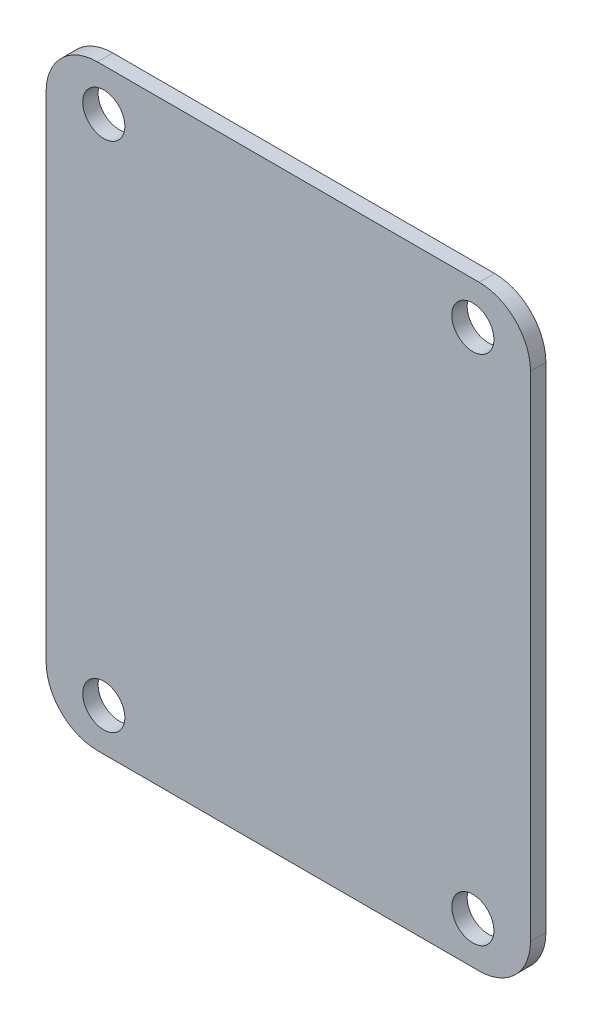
ISO-10303-21;
HEADER;
FILE_DESCRIPTION(('STEP AP214'),'2;1');
FILE_NAME('part.step','',(''),(''),'','','');
FILE_SCHEMA(('AUTOMOTIVE_DESIGN { 1 0 10303 214 1 1 1 1 }'));
ENDSEC;
DATA;
#1=APPLICATION_CONTEXT('core data for automotive mechanical design processes');
#2=APPLICATION_PROTOCOL_DEFINITION('international standard','automotive_design',2000,#1);
#3=PRODUCT_CONTEXT('',#1,'mechanical');
#4=PRODUCT('Part','Part','',(#3));
#5=PRODUCT_RELATED_PRODUCT_CATEGORY('part','',(#4));
#6=PRODUCT_DEFINITION_FORMATION('','',#4);
#7=PRODUCT_DEFINITION_CONTEXT('part definition',#1,'design');
#8=PRODUCT_DEFINITION('design','',#6,#7);
#9=PRODUCT_DEFINITION_SHAPE('','',#8);
#10=(LENGTH_UNIT() NAMED_UNIT(*) SI_UNIT(.MILLI.,.METRE.));
#11=(NAMED_UNIT(*) PLANE_ANGLE_UNIT() SI_UNIT($,.RADIAN.));
#12=(NAMED_UNIT(*) SI_UNIT($,.STERADIAN.) SOLID_ANGLE_UNIT());
#13=UNCERTAINTY_MEASURE_WITH_UNIT(LENGTH_MEASURE(1.E-05),#10,'distance_accuracy_value','');
#14=(GEOMETRIC_REPRESENTATION_CONTEXT(3) GLOBAL_UNCERTAINTY_ASSIGNED_CONTEXT((#13)) GLOBAL_UNIT_ASSIGNED_CONTEXT((#10,
#11,#12)) REPRESENTATION_CONTEXT('',''));
#15=CARTESIAN_POINT('',(0.,0.,0.));
#16=DIRECTION('',(0.,0.,1.));
#17=DIRECTION('',(1.,0.,0.));
#18=AXIS2_PLACEMENT_3D('',#15,#16,#17);
#19=CARTESIAN_POINT('',(9.56036396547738,4.48655547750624,0.762));
#20=DIRECTION('',(0.,0.,1.));
#21=DIRECTION('',(1.,0.,0.));
#22=AXIS2_PLACEMENT_3D('',#19,#20,#21);
#23=PLANE('',#22);
#24=CARTESIAN_POINT('',(9.24460824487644,-20.4244063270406,0.762));
#25=DIRECTION('',(0.,0.,1.));
#26=DIRECTION('',(1.,0.,0.));
#27=AXIS2_PLACEMENT_3D('',#24,#25,#26);
#28=CIRCLE('',#27,1.04267733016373);
#29=CARTESIAN_POINT('',(8.20193091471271,-20.4244063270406,0.762));
#30=VERTEX_POINT('',#29);
#31=EDGE_CURVE('E187',#30,#30,#28,.T.);
#32=ORIENTED_EDGE('',*,*,#31,.F.);
#33=EDGE_LOOP('',(#32));
#34=FACE_BOUND('',#33,.T.);
#35=CARTESIAN_POINT('',(-9.03286992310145,4.93740672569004,0.762));
#36=DIRECTION('',(0.,0.,1.));
#37=DIRECTION('',(1.,0.,0.));
#38=AXIS2_PLACEMENT_3D('',#35,#36,#37);
#39=CIRCLE('',#38,1.04267733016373);
#40=CARTESIAN_POINT('',(-10.0755472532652,4.93740672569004,0.762));
#41=VERTEX_POINT('',#40);
#42=EDGE_CURVE('E133',#41,#41,#39,.T.);
#43=ORIENTED_EDGE('',*,*,#42,.F.);
#44=EDGE_LOOP('',(#43));
#45=FACE_BOUND('',#44,.T.);
#46=CARTESIAN_POINT('',(9.56036396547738,4.48655547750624,0.762));
#47=DIRECTION('',(0.,0.,1.));
#48=DIRECTION('',(1.,0.,0.));
#49=AXIS2_PLACEMENT_3D('',#46,#47,#48);
#50=CIRCLE('',#49,2.54);
#51=CARTESIAN_POINT('',(12.1003639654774,4.48655547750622,0.762));
#52=VERTEX_POINT('',#51);
#53=CARTESIAN_POINT('',(9.56036396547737,7.02655547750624,0.762));
#54=VERTEX_POINT('',#53);
#55=EDGE_CURVE('E144',#52,#54,#50,.T.);
#56=ORIENTED_EDGE('',*,*,#55,.T.);
#57=DIRECTION('',(-1.,0.,0.));
#58=VECTOR('',#57,1.);
#59=CARTESIAN_POINT('',(-9.34862564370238,7.02655547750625,0.762));
#60=LINE('',#59,#58);
#61=CARTESIAN_POINT('',(-9.34862564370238,7.02655547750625,0.762));
#62=VERTEX_POINT('',#61);
#63=EDGE_CURVE('E92',#54,#62,#60,.T.);
#64=ORIENTED_EDGE('',*,*,#63,.T.);
#65=CARTESIAN_POINT('',(-9.3486256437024,4.48655547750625,0.762));
#66=DIRECTION('',(0.,0.,1.));
#67=DIRECTION('',(-1.,0.,0.));
#68=AXIS2_PLACEMENT_3D('',#65,#66,#67);
#69=CIRCLE('',#68,2.54);
#70=CARTESIAN_POINT('',(-11.8886256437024,4.48655547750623,0.762));
#71=VERTEX_POINT('',#70);
#72=EDGE_CURVE('E159',#62,#71,#69,.T.);
#73=ORIENTED_EDGE('',*,*,#72,.T.);
#74=DIRECTION('',(0.,-1.,0.));
#75=VECTOR('',#74,1.);
#76=CARTESIAN_POINT('',(-11.8886256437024,4.48655547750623,0.762));
#77=LINE('',#76,#75);
#78=CARTESIAN_POINT('',(-11.8886256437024,-19.9735550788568,0.762));
#79=VERTEX_POINT('',#78);
#80=EDGE_CURVE('E172',#71,#79,#77,.T.);
#81=ORIENTED_EDGE('',*,*,#80,.T.);
#82=CARTESIAN_POINT('',(-9.3486256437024,-19.9735550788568,0.762));
#83=DIRECTION('',(0.,0.,1.));
#84=DIRECTION('',(-1.,0.,0.));
#85=AXIS2_PLACEMENT_3D('',#82,#83,#84);
#86=CIRCLE('',#85,2.54);
#87=CARTESIAN_POINT('',(-9.34862564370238,-22.5135550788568,0.762));
#88=VERTEX_POINT('',#87);
#89=EDGE_CURVE('E111',#79,#88,#86,.T.);
#90=ORIENTED_EDGE('',*,*,#89,.T.);
#91=DIRECTION('',(1.,0.,0.));
#92=VECTOR('',#91,1.);
#93=CARTESIAN_POINT('',(-9.34862564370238,-22.5135550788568,0.762));
#94=LINE('',#93,#92);
#95=CARTESIAN_POINT('',(9.56036396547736,-22.5135550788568,0.762));
#96=VERTEX_POINT('',#95);
#97=EDGE_CURVE('E105',#88,#96,#94,.T.);
#98=ORIENTED_EDGE('',*,*,#97,.T.);
#99=CARTESIAN_POINT('',(9.56036396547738,-19.9735550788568,0.762));
#100=DIRECTION('',(0.,0.,1.));
#101=DIRECTION('',(-1.,0.,0.));
#102=AXIS2_PLACEMENT_3D('',#99,#100,#101);
#103=CIRCLE('',#102,2.54);
#104=CARTESIAN_POINT('',(12.1003639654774,-19.9735550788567,0.762));
#105=VERTEX_POINT('',#104);
#106=EDGE_CURVE('E109',#96,#105,#103,.T.);
#107=ORIENTED_EDGE('',*,*,#106,.T.);
#108=DIRECTION('',(0.,1.,0.));
#109=VECTOR('',#108,1.);
#110=CARTESIAN_POINT('',(12.1003639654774,4.48655547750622,0.762));
#111=LINE('',#110,#109);
#112=EDGE_CURVE('E49',#105,#52,#111,.T.);
#113=ORIENTED_EDGE('',*,*,#112,.T.);
#114=EDGE_LOOP('',(#56,#64,#73,#81,#90,#98,#107,#113));
#115=FACE_BOUND('',#114,.T.);
#116=CARTESIAN_POINT('',(9.24460824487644,4.93740672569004,0.762));
#117=DIRECTION('',(0.,0.,1.));
#118=DIRECTION('',(-1.,0.,0.));
#119=AXIS2_PLACEMENT_3D('',#116,#117,#118);
#120=CIRCLE('',#119,1.04267733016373);
#121=CARTESIAN_POINT('',(8.20193091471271,4.93740672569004,0.762));
#122=VERTEX_POINT('',#121);
#123=EDGE_CURVE('E181',#122,#122,#120,.T.);
#124=ORIENTED_EDGE('',*,*,#123,.F.);
#125=EDGE_LOOP('',(#124));
#126=FACE_BOUND('',#125,.T.);
#127=CARTESIAN_POINT('',(-9.03286992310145,-20.4244063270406,0.762));
#128=DIRECTION('',(0.,0.,1.));
#129=DIRECTION('',(-1.,0.,0.));
#130=AXIS2_PLACEMENT_3D('',#127,#128,#129);
#131=CIRCLE('',#130,1.04267733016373);
#132=CARTESIAN_POINT('',(-10.0755472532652,-20.4244063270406,0.762));
#133=VERTEX_POINT('',#132);
#134=EDGE_CURVE('E193',#133,#133,#131,.T.);
#135=ORIENTED_EDGE('',*,*,#134,.F.);
#136=EDGE_LOOP('',(#135));
#137=FACE_BOUND('',#136,.T.);
#138=ADVANCED_FACE('F32',(#34,#45,#115,#126,#137),#23,.T.);
#139=CARTESIAN_POINT('',(9.56036396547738,4.48655547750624,0.));
#140=DIRECTION('',(0.,0.,1.));
#141=DIRECTION('',(1.,0.,0.));
#142=AXIS2_PLACEMENT_3D('',#139,#140,#141);
#143=PLANE('',#142);
#144=CARTESIAN_POINT('',(9.24460824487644,-20.4244063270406,0.));
#145=DIRECTION('',(0.,0.,1.));
#146=DIRECTION('',(1.,0.,0.));
#147=AXIS2_PLACEMENT_3D('',#144,#145,#146);
#148=CIRCLE('',#147,1.04267733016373);
#149=CARTESIAN_POINT('',(8.20193091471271,-20.4244063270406,0.));
#150=VERTEX_POINT('',#149);
#151=EDGE_CURVE('E190',#150,#150,#148,.T.);
#152=ORIENTED_EDGE('',*,*,#151,.T.);
#153=EDGE_LOOP('',(#152));
#154=FACE_BOUND('',#153,.T.);
#155=CARTESIAN_POINT('',(-9.03286992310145,4.93740672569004,0.));
#156=DIRECTION('',(0.,0.,1.));
#157=DIRECTION('',(1.,0.,0.));
#158=AXIS2_PLACEMENT_3D('',#155,#156,#157);
#159=CIRCLE('',#158,1.04267733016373);
#160=CARTESIAN_POINT('',(-10.0755472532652,4.93740672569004,0.));
#161=VERTEX_POINT('',#160);
#162=EDGE_CURVE('E178',#161,#161,#159,.T.);
#163=ORIENTED_EDGE('',*,*,#162,.T.);
#164=EDGE_LOOP('',(#163));
#165=FACE_BOUND('',#164,.T.);
#166=CARTESIAN_POINT('',(9.56036396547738,4.48655547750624,0.));
#167=DIRECTION('',(0.,0.,1.));
#168=DIRECTION('',(1.,0.,0.));
#169=AXIS2_PLACEMENT_3D('',#166,#167,#168);
#170=CIRCLE('',#169,2.54);
#171=CARTESIAN_POINT('',(12.1003639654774,4.48655547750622,0.));
#172=VERTEX_POINT('',#171);
#173=CARTESIAN_POINT('',(9.56036396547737,7.02655547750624,0.));
#174=VERTEX_POINT('',#173);
#175=EDGE_CURVE('E129',#172,#174,#170,.T.);
#176=ORIENTED_EDGE('',*,*,#175,.F.);
#177=DIRECTION('',(0.,1.,0.));
#178=VECTOR('',#177,1.);
#179=CARTESIAN_POINT('',(12.1003639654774,4.48655547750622,0.));
#180=LINE('',#179,#178);
#181=CARTESIAN_POINT('',(12.1003639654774,-19.9735550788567,0.));
#182=VERTEX_POINT('',#181);
#183=EDGE_CURVE('E84',#182,#172,#180,.T.);
#184=ORIENTED_EDGE('',*,*,#183,.F.);
#185=CARTESIAN_POINT('',(9.56036396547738,-19.9735550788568,0.));
#186=DIRECTION('',(0.,0.,1.));
#187=DIRECTION('',(-1.,0.,0.));
#188=AXIS2_PLACEMENT_3D('',#185,#186,#187);
#189=CIRCLE('',#188,2.54);
#190=CARTESIAN_POINT('',(9.56036396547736,-22.5135550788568,0.));
#191=VERTEX_POINT('',#190);
#192=EDGE_CURVE('E78',#191,#182,#189,.T.);
#193=ORIENTED_EDGE('',*,*,#192,.F.);
#194=DIRECTION('',(1.,0.,0.));
#195=VECTOR('',#194,1.);
#196=CARTESIAN_POINT('',(-9.34862564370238,-22.5135550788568,0.));
#197=LINE('',#196,#195);
#198=CARTESIAN_POINT('',(-9.34862564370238,-22.5135550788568,0.));
#199=VERTEX_POINT('',#198);
#200=EDGE_CURVE('E119',#199,#191,#197,.T.);
#201=ORIENTED_EDGE('',*,*,#200,.F.);
#202=CARTESIAN_POINT('',(-9.3486256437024,-19.9735550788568,0.));
#203=DIRECTION('',(0.,0.,1.));
#204=DIRECTION('',(-1.,0.,0.));
#205=AXIS2_PLACEMENT_3D('',#202,#203,#204);
#206=CIRCLE('',#205,2.54);
#207=CARTESIAN_POINT('',(-11.8886256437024,-19.9735550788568,0.));
#208=VERTEX_POINT('',#207);
#209=EDGE_CURVE('E139',#208,#199,#206,.T.);
#210=ORIENTED_EDGE('',*,*,#209,.F.);
#211=DIRECTION('',(0.,-1.,0.));
#212=VECTOR('',#211,1.);
#213=CARTESIAN_POINT('',(-11.8886256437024,4.48655547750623,0.));
#214=LINE('',#213,#212);
#215=CARTESIAN_POINT('',(-11.8886256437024,4.48655547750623,0.));
#216=VERTEX_POINT('',#215);
#217=EDGE_CURVE('E137',#216,#208,#214,.T.);
#218=ORIENTED_EDGE('',*,*,#217,.F.);
#219=CARTESIAN_POINT('',(-9.3486256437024,4.48655547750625,0.));
#220=DIRECTION('',(0.,0.,1.));
#221=DIRECTION('',(-1.,0.,0.));
#222=AXIS2_PLACEMENT_3D('',#219,#220,#221);
#223=CIRCLE('',#222,2.54);
#224=CARTESIAN_POINT('',(-9.34862564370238,7.02655547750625,0.));
#225=VERTEX_POINT('',#224);
#226=EDGE_CURVE('E135',#225,#216,#223,.T.);
#227=ORIENTED_EDGE('',*,*,#226,.F.);
#228=DIRECTION('',(-1.,0.,0.));
#229=VECTOR('',#228,1.);
#230=CARTESIAN_POINT('',(-9.34862564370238,7.02655547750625,0.));
#231=LINE('',#230,#229);
#232=EDGE_CURVE('E132',#174,#225,#231,.T.);
#233=ORIENTED_EDGE('',*,*,#232,.F.);
#234=EDGE_LOOP('',(#176,#184,#193,#201,#210,#218,#227,#233));
#235=FACE_BOUND('',#234,.T.);
#236=CARTESIAN_POINT('',(9.24460824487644,4.93740672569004,0.));
#237=DIRECTION('',(0.,0.,1.));
#238=DIRECTION('',(-1.,0.,0.));
#239=AXIS2_PLACEMENT_3D('',#236,#237,#238);
#240=CIRCLE('',#239,1.04267733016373);
#241=CARTESIAN_POINT('',(8.20193091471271,4.93740672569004,0.));
#242=VERTEX_POINT('',#241);
#243=EDGE_CURVE('E184',#242,#242,#240,.T.);
#244=ORIENTED_EDGE('',*,*,#243,.T.);
#245=EDGE_LOOP('',(#244));
#246=FACE_BOUND('',#245,.T.);
#247=CARTESIAN_POINT('',(-9.03286992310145,-20.4244063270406,0.));
#248=DIRECTION('',(0.,0.,1.));
#249=DIRECTION('',(-1.,0.,0.));
#250=AXIS2_PLACEMENT_3D('',#247,#248,#249);
#251=CIRCLE('',#250,1.04267733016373);
#252=CARTESIAN_POINT('',(-10.0755472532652,-20.4244063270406,0.));
#253=VERTEX_POINT('',#252);
#254=EDGE_CURVE('E196',#253,#253,#251,.T.);
#255=ORIENTED_EDGE('',*,*,#254,.T.);
#256=EDGE_LOOP('',(#255));
#257=FACE_BOUND('',#256,.T.);
#258=ADVANCED_FACE('F163',(#154,#165,#235,#246,#257),#143,.F.);
#259=CARTESIAN_POINT('',(9.56036396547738,4.48655547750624,0.762));
#260=DIRECTION('',(0.,0.,-1.));
#261=DIRECTION('',(-1.,0.,0.));
#262=AXIS2_PLACEMENT_3D('',#259,#260,#261);
#263=CYLINDRICAL_SURFACE('',#262,2.54);
#264=ORIENTED_EDGE('',*,*,#175,.T.);
#265=DIRECTION('',(0.,0.,-1.));
#266=VECTOR('',#265,1.);
#267=CARTESIAN_POINT('',(9.56036396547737,7.02655547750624,0.762));
#268=LINE('',#267,#266);
#269=EDGE_CURVE('E11',#54,#174,#268,.T.);
#270=ORIENTED_EDGE('',*,*,#269,.F.);
#271=ORIENTED_EDGE('',*,*,#55,.F.);
#272=DIRECTION('',(0.,0.,-1.));
#273=VECTOR('',#272,1.);
#274=CARTESIAN_POINT('',(12.1003639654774,4.48655547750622,0.762));
#275=LINE('',#274,#273);
#276=EDGE_CURVE('E125',#52,#172,#275,.T.);
#277=ORIENTED_EDGE('',*,*,#276,.T.);
#278=EDGE_LOOP('',(#264,#270,#271,#277));
#279=FACE_BOUND('',#278,.T.);
#280=ADVANCED_FACE('F34',(#279),#263,.T.);
#281=CARTESIAN_POINT('',(-9.34862564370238,7.02655547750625,0.762));
#282=DIRECTION('',(0.,-1.,0.));
#283=DIRECTION('',(1.,0.,0.));
#284=AXIS2_PLACEMENT_3D('',#281,#282,#283);
#285=PLANE('',#284);
#286=ORIENTED_EDGE('',*,*,#232,.T.);
#287=DIRECTION('',(0.,0.,-1.));
#288=VECTOR('',#287,1.);
#289=CARTESIAN_POINT('',(-9.34862564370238,7.02655547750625,0.762));
#290=LINE('',#289,#288);
#291=EDGE_CURVE('E41',#62,#225,#290,.T.);
#292=ORIENTED_EDGE('',*,*,#291,.F.);
#293=ORIENTED_EDGE('',*,*,#63,.F.);
#294=ORIENTED_EDGE('',*,*,#269,.T.);
#295=EDGE_LOOP('',(#286,#292,#293,#294));
#296=FACE_BOUND('',#295,.T.);
#297=ADVANCED_FACE('F231',(#296),#285,.F.);
#298=CARTESIAN_POINT('',(-9.3486256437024,4.48655547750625,0.762));
#299=DIRECTION('',(0.,0.,-1.));
#300=DIRECTION('',(-1.,0.,0.));
#301=AXIS2_PLACEMENT_3D('',#298,#299,#300);
#302=CYLINDRICAL_SURFACE('',#301,2.54);
#303=ORIENTED_EDGE('',*,*,#226,.T.);
#304=DIRECTION('',(0.,0.,-1.));
#305=VECTOR('',#304,1.);
#306=CARTESIAN_POINT('',(-11.8886256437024,4.48655547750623,0.762));
#307=LINE('',#306,#305);
#308=EDGE_CURVE('E151',#71,#216,#307,.T.);
#309=ORIENTED_EDGE('',*,*,#308,.F.);
#310=ORIENTED_EDGE('',*,*,#72,.F.);
#311=ORIENTED_EDGE('',*,*,#291,.T.);
#312=EDGE_LOOP('',(#303,#309,#310,#311));
#313=FACE_BOUND('',#312,.T.);
#314=ADVANCED_FACE('F157',(#313),#302,.T.);
#315=CARTESIAN_POINT('',(-11.8886256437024,4.48655547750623,0.762));
#316=DIRECTION('',(1.,0.,0.));
#317=DIRECTION('',(0.,0.,-1.));
#318=AXIS2_PLACEMENT_3D('',#315,#316,#317);
#319=PLANE('',#318);
#320=ORIENTED_EDGE('',*,*,#217,.T.);
#321=DIRECTION('',(0.,0.,-1.));
#322=VECTOR('',#321,1.);
#323=CARTESIAN_POINT('',(-11.8886256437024,-19.9735550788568,0.762));
#324=LINE('',#323,#322);
#325=EDGE_CURVE('E148',#79,#208,#324,.T.);
#326=ORIENTED_EDGE('',*,*,#325,.F.);
#327=ORIENTED_EDGE('',*,*,#80,.F.);
#328=ORIENTED_EDGE('',*,*,#308,.T.);
#329=EDGE_LOOP('',(#320,#326,#327,#328));
#330=FACE_BOUND('',#329,.T.);
#331=ADVANCED_FACE('F168',(#330),#319,.F.);
#332=CARTESIAN_POINT('',(-9.3486256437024,-19.9735550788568,0.762));
#333=DIRECTION('',(0.,0.,-1.));
#334=DIRECTION('',(-1.,0.,0.));
#335=AXIS2_PLACEMENT_3D('',#332,#333,#334);
#336=CYLINDRICAL_SURFACE('',#335,2.54);
#337=ORIENTED_EDGE('',*,*,#209,.T.);
#338=DIRECTION('',(0.,0.,-1.));
#339=VECTOR('',#338,1.);
#340=CARTESIAN_POINT('',(-9.34862564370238,-22.5135550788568,0.762));
#341=LINE('',#340,#339);
#342=EDGE_CURVE('E120',#88,#199,#341,.T.);
#343=ORIENTED_EDGE('',*,*,#342,.F.);
#344=ORIENTED_EDGE('',*,*,#89,.F.);
#345=ORIENTED_EDGE('',*,*,#325,.T.);
#346=EDGE_LOOP('',(#337,#343,#344,#345));
#347=FACE_BOUND('',#346,.T.);
#348=ADVANCED_FACE('F171',(#347),#336,.T.);
#349=CARTESIAN_POINT('',(-9.34862564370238,-22.5135550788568,0.762));
#350=DIRECTION('',(0.,1.,0.));
#351=DIRECTION('',(-1.,0.,0.));
#352=AXIS2_PLACEMENT_3D('',#349,#350,#351);
#353=PLANE('',#352);
#354=ORIENTED_EDGE('',*,*,#200,.T.);
#355=DIRECTION('',(0.,0.,-1.));
#356=VECTOR('',#355,1.);
#357=CARTESIAN_POINT('',(9.56036396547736,-22.5135550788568,0.762));
#358=LINE('',#357,#356);
#359=EDGE_CURVE('E116',#96,#191,#358,.T.);
#360=ORIENTED_EDGE('',*,*,#359,.F.);
#361=ORIENTED_EDGE('',*,*,#97,.F.);
#362=ORIENTED_EDGE('',*,*,#342,.T.);
#363=EDGE_LOOP('',(#354,#360,#361,#362));
#364=FACE_BOUND('',#363,.T.);
#365=ADVANCED_FACE('F117',(#364),#353,.F.);
#366=CARTESIAN_POINT('',(9.56036396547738,-19.9735550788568,0.762));
#367=DIRECTION('',(0.,0.,-1.));
#368=DIRECTION('',(-1.,0.,0.));
#369=AXIS2_PLACEMENT_3D('',#366,#367,#368);
#370=CYLINDRICAL_SURFACE('',#369,2.54);
#371=ORIENTED_EDGE('',*,*,#192,.T.);
#372=DIRECTION('',(0.,0.,-1.));
#373=VECTOR('',#372,1.);
#374=CARTESIAN_POINT('',(12.1003639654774,-19.9735550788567,0.762));
#375=LINE('',#374,#373);
#376=EDGE_CURVE('E121',#105,#182,#375,.T.);
#377=ORIENTED_EDGE('',*,*,#376,.F.);
#378=ORIENTED_EDGE('',*,*,#106,.F.);
#379=ORIENTED_EDGE('',*,*,#359,.T.);
#380=EDGE_LOOP('',(#371,#377,#378,#379));
#381=FACE_BOUND('',#380,.T.);
#382=ADVANCED_FACE('F123',(#381),#370,.T.);
#383=CARTESIAN_POINT('',(12.1003639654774,4.48655547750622,0.762));
#384=DIRECTION('',(-1.,0.,0.));
#385=DIRECTION('',(0.,-1.,0.));
#386=AXIS2_PLACEMENT_3D('',#383,#384,#385);
#387=PLANE('',#386);
#388=ORIENTED_EDGE('',*,*,#183,.T.);
#389=ORIENTED_EDGE('',*,*,#276,.F.);
#390=ORIENTED_EDGE('',*,*,#112,.F.);
#391=ORIENTED_EDGE('',*,*,#376,.T.);
#392=EDGE_LOOP('',(#388,#389,#390,#391));
#393=FACE_BOUND('',#392,.T.);
#394=ADVANCED_FACE('F219',(#393),#387,.F.);
#395=CARTESIAN_POINT('',(-9.03286992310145,4.93740672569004,0.762));
#396=DIRECTION('',(0.,0.,-1.));
#397=DIRECTION('',(-1.,0.,0.));
#398=AXIS2_PLACEMENT_3D('',#395,#396,#397);
#399=CYLINDRICAL_SURFACE('',#398,1.04267733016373);
#400=CARTESIAN_POINT('',(-10.0755472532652,4.93740672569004,0.762));
#401=CARTESIAN_POINT('',(-10.0755472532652,4.93740672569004,0.7540625));
#402=CARTESIAN_POINT('',(-10.0755472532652,4.93740672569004,0.746125));
#403=CARTESIAN_POINT('',(-10.0755472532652,4.93740672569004,0.73025));
#404=CARTESIAN_POINT('',(-10.0755472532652,4.93740672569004,0.7223125));
#405=CARTESIAN_POINT('',(-10.0755472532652,4.93740672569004,0.7064375));
#406=CARTESIAN_POINT('',(-10.0755472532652,4.93740672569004,0.6985));
#407=CARTESIAN_POINT('',(-10.0755472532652,4.93740672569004,0.682625));
#408=CARTESIAN_POINT('',(-10.0755472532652,4.93740672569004,0.6746875));
#409=CARTESIAN_POINT('',(-10.0755472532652,4.93740672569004,0.6588125));
#410=CARTESIAN_POINT('',(-10.0755472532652,4.93740672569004,0.650875));
#411=CARTESIAN_POINT('',(-10.0755472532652,4.93740672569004,0.635));
#412=CARTESIAN_POINT('',(-10.0755472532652,4.93740672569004,0.6270625));
#413=CARTESIAN_POINT('',(-10.0755472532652,4.93740672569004,0.6111875));
#414=CARTESIAN_POINT('',(-10.0755472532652,4.93740672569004,0.60325));
#415=CARTESIAN_POINT('',(-10.0755472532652,4.93740672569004,0.587375));
#416=CARTESIAN_POINT('',(-10.0755472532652,4.93740672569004,0.5794375));
#417=CARTESIAN_POINT('',(-10.0755472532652,4.93740672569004,0.5635625));
#418=CARTESIAN_POINT('',(-10.0755472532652,4.93740672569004,0.555625));
#419=CARTESIAN_POINT('',(-10.0755472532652,4.93740672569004,0.53975));
#420=CARTESIAN_POINT('',(-10.0755472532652,4.93740672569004,0.5318125));
#421=CARTESIAN_POINT('',(-10.0755472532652,4.93740672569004,0.5159375));
#422=CARTESIAN_POINT('',(-10.0755472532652,4.93740672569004,0.508));
#423=CARTESIAN_POINT('',(-10.0755472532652,4.93740672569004,0.492125));
#424=CARTESIAN_POINT('',(-10.0755472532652,4.93740672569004,0.4841875));
#425=CARTESIAN_POINT('',(-10.0755472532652,4.93740672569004,0.4683125));
#426=CARTESIAN_POINT('',(-10.0755472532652,4.93740672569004,0.460375));
#427=CARTESIAN_POINT('',(-10.0755472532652,4.93740672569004,0.4445));
#428=CARTESIAN_POINT('',(-10.0755472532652,4.93740672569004,0.4365625));
#429=CARTESIAN_POINT('',(-10.0755472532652,4.93740672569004,0.4206875));
#430=CARTESIAN_POINT('',(-10.0755472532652,4.93740672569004,0.41275));
#431=CARTESIAN_POINT('',(-10.0755472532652,4.93740672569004,0.396875));
#432=CARTESIAN_POINT('',(-10.0755472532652,4.93740672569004,0.3889375));
#433=CARTESIAN_POINT('',(-10.0755472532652,4.93740672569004,0.3730625));
#434=CARTESIAN_POINT('',(-10.0755472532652,4.93740672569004,0.365125));
#435=CARTESIAN_POINT('',(-10.0755472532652,4.93740672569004,0.34925));
#436=CARTESIAN_POINT('',(-10.0755472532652,4.93740672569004,0.3413125));
#437=CARTESIAN_POINT('',(-10.0755472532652,4.93740672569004,0.3254375));
#438=CARTESIAN_POINT('',(-10.0755472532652,4.93740672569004,0.3175));
#439=CARTESIAN_POINT('',(-10.0755472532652,4.93740672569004,0.301625));
#440=CARTESIAN_POINT('',(-10.0755472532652,4.93740672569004,0.2936875));
#441=CARTESIAN_POINT('',(-10.0755472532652,4.93740672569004,0.2778125));
#442=CARTESIAN_POINT('',(-10.0755472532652,4.93740672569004,0.269875));
#443=CARTESIAN_POINT('',(-10.0755472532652,4.93740672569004,0.254));
#444=CARTESIAN_POINT('',(-10.0755472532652,4.93740672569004,0.2460625));
#445=CARTESIAN_POINT('',(-10.0755472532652,4.93740672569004,0.2301875));
#446=CARTESIAN_POINT('',(-10.0755472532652,4.93740672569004,0.22225));
#447=CARTESIAN_POINT('',(-10.0755472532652,4.93740672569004,0.206375));
#448=CARTESIAN_POINT('',(-10.0755472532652,4.93740672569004,0.1984375));
#449=CARTESIAN_POINT('',(-10.0755472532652,4.93740672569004,0.1825625));
#450=CARTESIAN_POINT('',(-10.0755472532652,4.93740672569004,0.174625));
#451=CARTESIAN_POINT('',(-10.0755472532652,4.93740672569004,0.15875));
#452=CARTESIAN_POINT('',(-10.0755472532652,4.93740672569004,0.1508125));
#453=CARTESIAN_POINT('',(-10.0755472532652,4.93740672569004,0.1349375));
#454=CARTESIAN_POINT('',(-10.0755472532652,4.93740672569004,0.127));
#455=CARTESIAN_POINT('',(-10.0755472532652,4.93740672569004,0.111125));
#456=CARTESIAN_POINT('',(-10.0755472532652,4.93740672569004,0.1031875));
#457=CARTESIAN_POINT('',(-10.0755472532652,4.93740672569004,0.0873125));
#458=CARTESIAN_POINT('',(-10.0755472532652,4.93740672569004,0.079375));
#459=CARTESIAN_POINT('',(-10.0755472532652,4.93740672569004,0.0635));
#460=CARTESIAN_POINT('',(-10.0755472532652,4.93740672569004,0.0555625));
#461=CARTESIAN_POINT('',(-10.0755472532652,4.93740672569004,0.0396875));
#462=CARTESIAN_POINT('',(-10.0755472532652,4.93740672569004,0.03175));
#463=CARTESIAN_POINT('',(-10.0755472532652,4.93740672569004,0.015875));
#464=CARTESIAN_POINT('',(-10.0755472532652,4.93740672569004,0.00793749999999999));
#465=CARTESIAN_POINT('',(-10.0755472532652,4.93740672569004,0.));
#466=B_SPLINE_CURVE_WITH_KNOTS('',3,(#400,#401,#402,#403,#404,#405,#406,#407,#408,#409,#410,
#411,#412,#413,#414,#415,#416,#417,#418,#419,#420,#421,#422,#423,#424,#425,#426,#427,#428,#429,
#430,#431,#432,#433,#434,#435,#436,#437,#438,#439,#440,#441,#442,#443,#444,#445,#446,#447,#448,
#449,#450,#451,#452,#453,#454,#455,#456,#457,#458,#459,#460,#461,#462,#463,#464,#465),
.UNSPECIFIED.,.F.,.F.,(4,2,2,2,2,2,2,2,2,2,2,2,2,2,2,2,2,2,2,2,2,2,2,2,2,2,2,2,2,2,2,2,4),(0.,
0.0238125,0.0476249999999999,0.0714374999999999,0.09525,0.1190625,0.142875,0.1666875,0.1905,
0.2143125,0.238125,0.2619375,0.28575,0.3095625,0.333375,0.3571875,0.381,0.4048125,0.428625,
0.4524375,0.47625,0.5000625,0.523875,0.5476875,0.5715,0.5953125,0.619125,0.6429375,0.66675,
0.6905625,0.714375,0.7381875,0.762),.UNSPECIFIED.);
#467=EDGE_CURVE('BSEAM216',#41,#161,#466,.T.);
#468=ORIENTED_EDGE('',*,*,#42,.T.);
#469=ORIENTED_EDGE('',*,*,#162,.F.);
#470=ORIENTED_EDGE('',*,*,#467,.T.);
#471=ORIENTED_EDGE('',*,*,#467,.F.);
#472=EDGE_LOOP('',(#468,#470,#469,#471));
#473=FACE_BOUND('',#472,.T.);
#474=ADVANCED_FACE('F216',(#473),#399,.F.);
#475=CARTESIAN_POINT('',(9.24460824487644,4.93740672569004,0.762));
#476=DIRECTION('',(0.,0.,-1.));
#477=DIRECTION('',(-1.,0.,0.));
#478=AXIS2_PLACEMENT_3D('',#475,#476,#477);
#479=CYLINDRICAL_SURFACE('',#478,1.04267733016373);
#480=CARTESIAN_POINT('',(8.20193091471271,4.93740672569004,0.762));
#481=CARTESIAN_POINT('',(8.20193091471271,4.93740672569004,0.7540625));
#482=CARTESIAN_POINT('',(8.20193091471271,4.93740672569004,0.746125));
#483=CARTESIAN_POINT('',(8.20193091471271,4.93740672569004,0.73025));
#484=CARTESIAN_POINT('',(8.20193091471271,4.93740672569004,0.7223125));
#485=CARTESIAN_POINT('',(8.20193091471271,4.93740672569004,0.7064375));
#486=CARTESIAN_POINT('',(8.20193091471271,4.93740672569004,0.6985));
#487=CARTESIAN_POINT('',(8.20193091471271,4.93740672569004,0.682625));
#488=CARTESIAN_POINT('',(8.20193091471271,4.93740672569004,0.6746875));
#489=CARTESIAN_POINT('',(8.20193091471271,4.93740672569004,0.6588125));
#490=CARTESIAN_POINT('',(8.20193091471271,4.93740672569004,0.650875));
#491=CARTESIAN_POINT('',(8.20193091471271,4.93740672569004,0.635));
#492=CARTESIAN_POINT('',(8.20193091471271,4.93740672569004,0.6270625));
#493=CARTESIAN_POINT('',(8.20193091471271,4.93740672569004,0.6111875));
#494=CARTESIAN_POINT('',(8.20193091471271,4.93740672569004,0.60325));
#495=CARTESIAN_POINT('',(8.20193091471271,4.93740672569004,0.587375));
#496=CARTESIAN_POINT('',(8.20193091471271,4.93740672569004,0.5794375));
#497=CARTESIAN_POINT('',(8.20193091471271,4.93740672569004,0.5635625));
#498=CARTESIAN_POINT('',(8.20193091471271,4.93740672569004,0.555625));
#499=CARTESIAN_POINT('',(8.20193091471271,4.93740672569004,0.53975));
#500=CARTESIAN_POINT('',(8.20193091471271,4.93740672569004,0.5318125));
#501=CARTESIAN_POINT('',(8.20193091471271,4.93740672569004,0.5159375));
#502=CARTESIAN_POINT('',(8.20193091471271,4.93740672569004,0.508));
#503=CARTESIAN_POINT('',(8.20193091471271,4.93740672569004,0.492125));
#504=CARTESIAN_POINT('',(8.20193091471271,4.93740672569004,0.4841875));
#505=CARTESIAN_POINT('',(8.20193091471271,4.93740672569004,0.4683125));
#506=CARTESIAN_POINT('',(8.20193091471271,4.93740672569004,0.460375));
#507=CARTESIAN_POINT('',(8.20193091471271,4.93740672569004,0.4445));
#508=CARTESIAN_POINT('',(8.20193091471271,4.93740672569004,0.4365625));
#509=CARTESIAN_POINT('',(8.20193091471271,4.93740672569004,0.4206875));
#510=CARTESIAN_POINT('',(8.20193091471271,4.93740672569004,0.41275));
#511=CARTESIAN_POINT('',(8.20193091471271,4.93740672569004,0.396875));
#512=CARTESIAN_POINT('',(8.20193091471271,4.93740672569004,0.3889375));
#513=CARTESIAN_POINT('',(8.20193091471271,4.93740672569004,0.3730625));
#514=CARTESIAN_POINT('',(8.20193091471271,4.93740672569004,0.365125));
#515=CARTESIAN_POINT('',(8.20193091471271,4.93740672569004,0.34925));
#516=CARTESIAN_POINT('',(8.20193091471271,4.93740672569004,0.3413125));
#517=CARTESIAN_POINT('',(8.20193091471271,4.93740672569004,0.3254375));
#518=CARTESIAN_POINT('',(8.20193091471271,4.93740672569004,0.3175));
#519=CARTESIAN_POINT('',(8.20193091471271,4.93740672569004,0.301625));
#520=CARTESIAN_POINT('',(8.20193091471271,4.93740672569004,0.2936875));
#521=CARTESIAN_POINT('',(8.20193091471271,4.93740672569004,0.2778125));
#522=CARTESIAN_POINT('',(8.20193091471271,4.93740672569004,0.269875));
#523=CARTESIAN_POINT('',(8.20193091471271,4.93740672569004,0.254));
#524=CARTESIAN_POINT('',(8.20193091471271,4.93740672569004,0.2460625));
#525=CARTESIAN_POINT('',(8.20193091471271,4.93740672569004,0.2301875));
#526=CARTESIAN_POINT('',(8.20193091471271,4.93740672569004,0.22225));
#527=CARTESIAN_POINT('',(8.20193091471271,4.93740672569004,0.206375));
#528=CARTESIAN_POINT('',(8.20193091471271,4.93740672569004,0.1984375));
#529=CARTESIAN_POINT('',(8.20193091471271,4.93740672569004,0.1825625));
#530=CARTESIAN_POINT('',(8.20193091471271,4.93740672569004,0.174625));
#531=CARTESIAN_POINT('',(8.20193091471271,4.93740672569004,0.15875));
#532=CARTESIAN_POINT('',(8.20193091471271,4.93740672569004,0.1508125));
#533=CARTESIAN_POINT('',(8.20193091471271,4.93740672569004,0.1349375));
#534=CARTESIAN_POINT('',(8.20193091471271,4.93740672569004,0.127));
#535=CARTESIAN_POINT('',(8.20193091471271,4.93740672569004,0.111125));
#536=CARTESIAN_POINT('',(8.20193091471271,4.93740672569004,0.1031875));
#537=CARTESIAN_POINT('',(8.20193091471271,4.93740672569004,0.0873125));
#538=CARTESIAN_POINT('',(8.20193091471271,4.93740672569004,0.079375));
#539=CARTESIAN_POINT('',(8.20193091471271,4.93740672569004,0.0635));
#540=CARTESIAN_POINT('',(8.20193091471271,4.93740672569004,0.0555625));
#541=CARTESIAN_POINT('',(8.20193091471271,4.93740672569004,0.0396875));
#542=CARTESIAN_POINT('',(8.20193091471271,4.93740672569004,0.03175));
#543=CARTESIAN_POINT('',(8.20193091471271,4.93740672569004,0.015875));
#544=CARTESIAN_POINT('',(8.20193091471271,4.93740672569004,0.00793749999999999));
#545=CARTESIAN_POINT('',(8.20193091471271,4.93740672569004,0.));
#546=B_SPLINE_CURVE_WITH_KNOTS('',3,(#480,#481,#482,#483,#484,#485,#486,#487,#488,#489,#490,
#491,#492,#493,#494,#495,#496,#497,#498,#499,#500,#501,#502,#503,#504,#505,#506,#507,#508,#509,
#510,#511,#512,#513,#514,#515,#516,#517,#518,#519,#520,#521,#522,#523,#524,#525,#526,#527,#528,
#529,#530,#531,#532,#533,#534,#535,#536,#537,#538,#539,#540,#541,#542,#543,#544,#545),
.UNSPECIFIED.,.F.,.F.,(4,2,2,2,2,2,2,2,2,2,2,2,2,2,2,2,2,2,2,2,2,2,2,2,2,2,2,2,2,2,2,2,4),(0.,
0.0238125,0.0476249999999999,0.0714374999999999,0.09525,0.1190625,0.142875,0.1666875,0.1905,
0.2143125,0.238125,0.2619375,0.28575,0.3095625,0.333375,0.3571875,0.381,0.4048125,0.428625,
0.4524375,0.47625,0.5000625,0.523875,0.5476875,0.5715,0.5953125,0.619125,0.6429375,0.66675,
0.6905625,0.714375,0.7381875,0.762),.UNSPECIFIED.);
#547=EDGE_CURVE('BSEAM295',#122,#242,#546,.T.);
#548=ORIENTED_EDGE('',*,*,#123,.T.);
#549=ORIENTED_EDGE('',*,*,#243,.F.);
#550=ORIENTED_EDGE('',*,*,#547,.T.);
#551=ORIENTED_EDGE('',*,*,#547,.F.);
#552=EDGE_LOOP('',(#548,#550,#549,#551));
#553=FACE_BOUND('',#552,.T.);
#554=ADVANCED_FACE('F295',(#553),#479,.F.);
#555=CARTESIAN_POINT('',(9.24460824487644,-20.4244063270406,0.762));
#556=DIRECTION('',(0.,0.,-1.));
#557=DIRECTION('',(-1.,0.,0.));
#558=AXIS2_PLACEMENT_3D('',#555,#556,#557);
#559=CYLINDRICAL_SURFACE('',#558,1.04267733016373);
#560=CARTESIAN_POINT('',(8.20193091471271,-20.4244063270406,0.762));
#561=CARTESIAN_POINT('',(8.20193091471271,-20.4244063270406,0.7540625));
#562=CARTESIAN_POINT('',(8.20193091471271,-20.4244063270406,0.746125));
#563=CARTESIAN_POINT('',(8.20193091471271,-20.4244063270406,0.73025));
#564=CARTESIAN_POINT('',(8.20193091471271,-20.4244063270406,0.7223125));
#565=CARTESIAN_POINT('',(8.20193091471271,-20.4244063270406,0.7064375));
#566=CARTESIAN_POINT('',(8.20193091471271,-20.4244063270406,0.6985));
#567=CARTESIAN_POINT('',(8.20193091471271,-20.4244063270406,0.682625));
#568=CARTESIAN_POINT('',(8.20193091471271,-20.4244063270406,0.6746875));
#569=CARTESIAN_POINT('',(8.20193091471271,-20.4244063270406,0.6588125));
#570=CARTESIAN_POINT('',(8.20193091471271,-20.4244063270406,0.650875));
#571=CARTESIAN_POINT('',(8.20193091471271,-20.4244063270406,0.635));
#572=CARTESIAN_POINT('',(8.20193091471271,-20.4244063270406,0.6270625));
#573=CARTESIAN_POINT('',(8.20193091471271,-20.4244063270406,0.6111875));
#574=CARTESIAN_POINT('',(8.20193091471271,-20.4244063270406,0.60325));
#575=CARTESIAN_POINT('',(8.20193091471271,-20.4244063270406,0.587375));
#576=CARTESIAN_POINT('',(8.20193091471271,-20.4244063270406,0.5794375));
#577=CARTESIAN_POINT('',(8.20193091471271,-20.4244063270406,0.5635625));
#578=CARTESIAN_POINT('',(8.20193091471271,-20.4244063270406,0.555625));
#579=CARTESIAN_POINT('',(8.20193091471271,-20.4244063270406,0.53975));
#580=CARTESIAN_POINT('',(8.20193091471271,-20.4244063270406,0.5318125));
#581=CARTESIAN_POINT('',(8.20193091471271,-20.4244063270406,0.5159375));
#582=CARTESIAN_POINT('',(8.20193091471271,-20.4244063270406,0.508));
#583=CARTESIAN_POINT('',(8.20193091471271,-20.4244063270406,0.492125));
#584=CARTESIAN_POINT('',(8.20193091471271,-20.4244063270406,0.4841875));
#585=CARTESIAN_POINT('',(8.20193091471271,-20.4244063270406,0.4683125));
#586=CARTESIAN_POINT('',(8.20193091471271,-20.4244063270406,0.460375));
#587=CARTESIAN_POINT('',(8.20193091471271,-20.4244063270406,0.4445));
#588=CARTESIAN_POINT('',(8.20193091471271,-20.4244063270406,0.4365625));
#589=CARTESIAN_POINT('',(8.20193091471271,-20.4244063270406,0.4206875));
#590=CARTESIAN_POINT('',(8.20193091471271,-20.4244063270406,0.41275));
#591=CARTESIAN_POINT('',(8.20193091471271,-20.4244063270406,0.396875));
#592=CARTESIAN_POINT('',(8.20193091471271,-20.4244063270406,0.3889375));
#593=CARTESIAN_POINT('',(8.20193091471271,-20.4244063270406,0.3730625));
#594=CARTESIAN_POINT('',(8.20193091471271,-20.4244063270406,0.365125));
#595=CARTESIAN_POINT('',(8.20193091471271,-20.4244063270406,0.34925));
#596=CARTESIAN_POINT('',(8.20193091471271,-20.4244063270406,0.3413125));
#597=CARTESIAN_POINT('',(8.20193091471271,-20.4244063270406,0.3254375));
#598=CARTESIAN_POINT('',(8.20193091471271,-20.4244063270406,0.3175));
#599=CARTESIAN_POINT('',(8.20193091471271,-20.4244063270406,0.301625));
#600=CARTESIAN_POINT('',(8.20193091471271,-20.4244063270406,0.2936875));
#601=CARTESIAN_POINT('',(8.20193091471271,-20.4244063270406,0.2778125));
#602=CARTESIAN_POINT('',(8.20193091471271,-20.4244063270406,0.269875));
#603=CARTESIAN_POINT('',(8.20193091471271,-20.4244063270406,0.254));
#604=CARTESIAN_POINT('',(8.20193091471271,-20.4244063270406,0.2460625));
#605=CARTESIAN_POINT('',(8.20193091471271,-20.4244063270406,0.2301875));
#606=CARTESIAN_POINT('',(8.20193091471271,-20.4244063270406,0.22225));
#607=CARTESIAN_POINT('',(8.20193091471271,-20.4244063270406,0.206375));
#608=CARTESIAN_POINT('',(8.20193091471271,-20.4244063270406,0.1984375));
#609=CARTESIAN_POINT('',(8.20193091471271,-20.4244063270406,0.1825625));
#610=CARTESIAN_POINT('',(8.20193091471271,-20.4244063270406,0.174625));
#611=CARTESIAN_POINT('',(8.20193091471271,-20.4244063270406,0.15875));
#612=CARTESIAN_POINT('',(8.20193091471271,-20.4244063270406,0.1508125));
#613=CARTESIAN_POINT('',(8.20193091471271,-20.4244063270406,0.1349375));
#614=CARTESIAN_POINT('',(8.20193091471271,-20.4244063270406,0.127));
#615=CARTESIAN_POINT('',(8.20193091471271,-20.4244063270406,0.111125));
#616=CARTESIAN_POINT('',(8.20193091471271,-20.4244063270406,0.1031875));
#617=CARTESIAN_POINT('',(8.20193091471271,-20.4244063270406,0.0873125));
#618=CARTESIAN_POINT('',(8.20193091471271,-20.4244063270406,0.079375));
#619=CARTESIAN_POINT('',(8.20193091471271,-20.4244063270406,0.0635));
#620=CARTESIAN_POINT('',(8.20193091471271,-20.4244063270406,0.0555625));
#621=CARTESIAN_POINT('',(8.20193091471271,-20.4244063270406,0.0396875));
#622=CARTESIAN_POINT('',(8.20193091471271,-20.4244063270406,0.03175));
#623=CARTESIAN_POINT('',(8.20193091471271,-20.4244063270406,0.015875));
#624=CARTESIAN_POINT('',(8.20193091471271,-20.4244063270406,0.00793749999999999));
#625=CARTESIAN_POINT('',(8.20193091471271,-20.4244063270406,0.));
#626=B_SPLINE_CURVE_WITH_KNOTS('',3,(#560,#561,#562,#563,#564,#565,#566,#567,#568,#569,#570,
#571,#572,#573,#574,#575,#576,#577,#578,#579,#580,#581,#582,#583,#584,#585,#586,#587,#588,#589,
#590,#591,#592,#593,#594,#595,#596,#597,#598,#599,#600,#601,#602,#603,#604,#605,#606,#607,#608,
#609,#610,#611,#612,#613,#614,#615,#616,#617,#618,#619,#620,#621,#622,#623,#624,#625),
.UNSPECIFIED.,.F.,.F.,(4,2,2,2,2,2,2,2,2,2,2,2,2,2,2,2,2,2,2,2,2,2,2,2,2,2,2,2,2,2,2,2,4),(0.,
0.0238125,0.0476249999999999,0.0714374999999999,0.09525,0.1190625,0.142875,0.1666875,0.1905,
0.2143125,0.238125,0.2619375,0.28575,0.3095625,0.333375,0.3571875,0.381,0.4048125,0.428625,
0.4524375,0.47625,0.5000625,0.523875,0.5476875,0.5715,0.5953125,0.619125,0.6429375,0.66675,
0.6905625,0.714375,0.7381875,0.762),.UNSPECIFIED.);
#627=EDGE_CURVE('BSEAM303',#30,#150,#626,.T.);
#628=ORIENTED_EDGE('',*,*,#31,.T.);
#629=ORIENTED_EDGE('',*,*,#151,.F.);
#630=ORIENTED_EDGE('',*,*,#627,.T.);
#631=ORIENTED_EDGE('',*,*,#627,.F.);
#632=EDGE_LOOP('',(#628,#630,#629,#631));
#633=FACE_BOUND('',#632,.T.);
#634=ADVANCED_FACE('F303',(#633),#559,.F.);
#635=CARTESIAN_POINT('',(-9.03286992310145,-20.4244063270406,0.762));
#636=DIRECTION('',(0.,0.,-1.));
#637=DIRECTION('',(-1.,0.,0.));
#638=AXIS2_PLACEMENT_3D('',#635,#636,#637);
#639=CYLINDRICAL_SURFACE('',#638,1.04267733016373);
#640=CARTESIAN_POINT('',(-10.0755472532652,-20.4244063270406,0.762));
#641=CARTESIAN_POINT('',(-10.0755472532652,-20.4244063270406,0.7540625));
#642=CARTESIAN_POINT('',(-10.0755472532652,-20.4244063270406,0.746125));
#643=CARTESIAN_POINT('',(-10.0755472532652,-20.4244063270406,0.73025));
#644=CARTESIAN_POINT('',(-10.0755472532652,-20.4244063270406,0.7223125));
#645=CARTESIAN_POINT('',(-10.0755472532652,-20.4244063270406,0.7064375));
#646=CARTESIAN_POINT('',(-10.0755472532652,-20.4244063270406,0.6985));
#647=CARTESIAN_POINT('',(-10.0755472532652,-20.4244063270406,0.682625));
#648=CARTESIAN_POINT('',(-10.0755472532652,-20.4244063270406,0.6746875));
#649=CARTESIAN_POINT('',(-10.0755472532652,-20.4244063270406,0.6588125));
#650=CARTESIAN_POINT('',(-10.0755472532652,-20.4244063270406,0.650875));
#651=CARTESIAN_POINT('',(-10.0755472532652,-20.4244063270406,0.635));
#652=CARTESIAN_POINT('',(-10.0755472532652,-20.4244063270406,0.6270625));
#653=CARTESIAN_POINT('',(-10.0755472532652,-20.4244063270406,0.6111875));
#654=CARTESIAN_POINT('',(-10.0755472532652,-20.4244063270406,0.60325));
#655=CARTESIAN_POINT('',(-10.0755472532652,-20.4244063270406,0.587375));
#656=CARTESIAN_POINT('',(-10.0755472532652,-20.4244063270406,0.5794375));
#657=CARTESIAN_POINT('',(-10.0755472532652,-20.4244063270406,0.5635625));
#658=CARTESIAN_POINT('',(-10.0755472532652,-20.4244063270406,0.555625));
#659=CARTESIAN_POINT('',(-10.0755472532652,-20.4244063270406,0.53975));
#660=CARTESIAN_POINT('',(-10.0755472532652,-20.4244063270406,0.5318125));
#661=CARTESIAN_POINT('',(-10.0755472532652,-20.4244063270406,0.5159375));
#662=CARTESIAN_POINT('',(-10.0755472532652,-20.4244063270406,0.508));
#663=CARTESIAN_POINT('',(-10.0755472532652,-20.4244063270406,0.492125));
#664=CARTESIAN_POINT('',(-10.0755472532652,-20.4244063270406,0.4841875));
#665=CARTESIAN_POINT('',(-10.0755472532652,-20.4244063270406,0.4683125));
#666=CARTESIAN_POINT('',(-10.0755472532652,-20.4244063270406,0.460375));
#667=CARTESIAN_POINT('',(-10.0755472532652,-20.4244063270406,0.4445));
#668=CARTESIAN_POINT('',(-10.0755472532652,-20.4244063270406,0.4365625));
#669=CARTESIAN_POINT('',(-10.0755472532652,-20.4244063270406,0.4206875));
#670=CARTESIAN_POINT('',(-10.0755472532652,-20.4244063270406,0.41275));
#671=CARTESIAN_POINT('',(-10.0755472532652,-20.4244063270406,0.396875));
#672=CARTESIAN_POINT('',(-10.0755472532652,-20.4244063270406,0.3889375));
#673=CARTESIAN_POINT('',(-10.0755472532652,-20.4244063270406,0.3730625));
#674=CARTESIAN_POINT('',(-10.0755472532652,-20.4244063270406,0.365125));
#675=CARTESIAN_POINT('',(-10.0755472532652,-20.4244063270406,0.34925));
#676=CARTESIAN_POINT('',(-10.0755472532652,-20.4244063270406,0.3413125));
#677=CARTESIAN_POINT('',(-10.0755472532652,-20.4244063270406,0.3254375));
#678=CARTESIAN_POINT('',(-10.0755472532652,-20.4244063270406,0.3175));
#679=CARTESIAN_POINT('',(-10.0755472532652,-20.4244063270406,0.301625));
#680=CARTESIAN_POINT('',(-10.0755472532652,-20.4244063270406,0.2936875));
#681=CARTESIAN_POINT('',(-10.0755472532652,-20.4244063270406,0.2778125));
#682=CARTESIAN_POINT('',(-10.0755472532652,-20.4244063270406,0.269875));
#683=CARTESIAN_POINT('',(-10.0755472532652,-20.4244063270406,0.254));
#684=CARTESIAN_POINT('',(-10.0755472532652,-20.4244063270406,0.2460625));
#685=CARTESIAN_POINT('',(-10.0755472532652,-20.4244063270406,0.2301875));
#686=CARTESIAN_POINT('',(-10.0755472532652,-20.4244063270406,0.22225));
#687=CARTESIAN_POINT('',(-10.0755472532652,-20.4244063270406,0.206375));
#688=CARTESIAN_POINT('',(-10.0755472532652,-20.4244063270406,0.1984375));
#689=CARTESIAN_POINT('',(-10.0755472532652,-20.4244063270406,0.1825625));
#690=CARTESIAN_POINT('',(-10.0755472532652,-20.4244063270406,0.174625));
#691=CARTESIAN_POINT('',(-10.0755472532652,-20.4244063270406,0.15875));
#692=CARTESIAN_POINT('',(-10.0755472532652,-20.4244063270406,0.1508125));
#693=CARTESIAN_POINT('',(-10.0755472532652,-20.4244063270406,0.1349375));
#694=CARTESIAN_POINT('',(-10.0755472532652,-20.4244063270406,0.127));
#695=CARTESIAN_POINT('',(-10.0755472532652,-20.4244063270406,0.111125));
#696=CARTESIAN_POINT('',(-10.0755472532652,-20.4244063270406,0.1031875));
#697=CARTESIAN_POINT('',(-10.0755472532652,-20.4244063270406,0.0873125));
#698=CARTESIAN_POINT('',(-10.0755472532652,-20.4244063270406,0.079375));
#699=CARTESIAN_POINT('',(-10.0755472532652,-20.4244063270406,0.0635));
#700=CARTESIAN_POINT('',(-10.0755472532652,-20.4244063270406,0.0555625));
#701=CARTESIAN_POINT('',(-10.0755472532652,-20.4244063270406,0.0396875));
#702=CARTESIAN_POINT('',(-10.0755472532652,-20.4244063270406,0.03175));
#703=CARTESIAN_POINT('',(-10.0755472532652,-20.4244063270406,0.015875));
#704=CARTESIAN_POINT('',(-10.0755472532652,-20.4244063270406,0.00793749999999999));
#705=CARTESIAN_POINT('',(-10.0755472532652,-20.4244063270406,0.));
#706=B_SPLINE_CURVE_WITH_KNOTS('',3,(#640,#641,#642,#643,#644,#645,#646,#647,#648,#649,#650,
#651,#652,#653,#654,#655,#656,#657,#658,#659,#660,#661,#662,#663,#664,#665,#666,#667,#668,#669,
#670,#671,#672,#673,#674,#675,#676,#677,#678,#679,#680,#681,#682,#683,#684,#685,#686,#687,#688,
#689,#690,#691,#692,#693,#694,#695,#696,#697,#698,#699,#700,#701,#702,#703,#704,#705),
.UNSPECIFIED.,.F.,.F.,(4,2,2,2,2,2,2,2,2,2,2,2,2,2,2,2,2,2,2,2,2,2,2,2,2,2,2,2,2,2,2,2,4),(0.,
0.0238125,0.0476249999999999,0.0714374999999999,0.09525,0.1190625,0.142875,0.1666875,0.1905,
0.2143125,0.238125,0.2619375,0.28575,0.3095625,0.333375,0.3571875,0.381,0.4048125,0.428625,
0.4524375,0.47625,0.5000625,0.523875,0.5476875,0.5715,0.5953125,0.619125,0.6429375,0.66675,
0.6905625,0.714375,0.7381875,0.762),.UNSPECIFIED.);
#707=EDGE_CURVE('BSEAM202',#133,#253,#706,.T.);
#708=ORIENTED_EDGE('',*,*,#134,.T.);
#709=ORIENTED_EDGE('',*,*,#254,.F.);
#710=ORIENTED_EDGE('',*,*,#707,.T.);
#711=ORIENTED_EDGE('',*,*,#707,.F.);
#712=EDGE_LOOP('',(#708,#710,#709,#711));
#713=FACE_BOUND('',#712,.T.);
#714=ADVANCED_FACE('F202',(#713),#639,.F.);
#715=CLOSED_SHELL('',(#138,#258,#280,#297,#314,#331,#348,#365,#382,#394,#474,#554,#634,#714));
#716=MANIFOLD_SOLID_BREP('B2',#715);
#717=ADVANCED_BREP_SHAPE_REPRESENTATION('',(#18,#716),#14);
#718=SHAPE_DEFINITION_REPRESENTATION(#9,#717);
ENDSEC;
END-ISO-10303-21;
